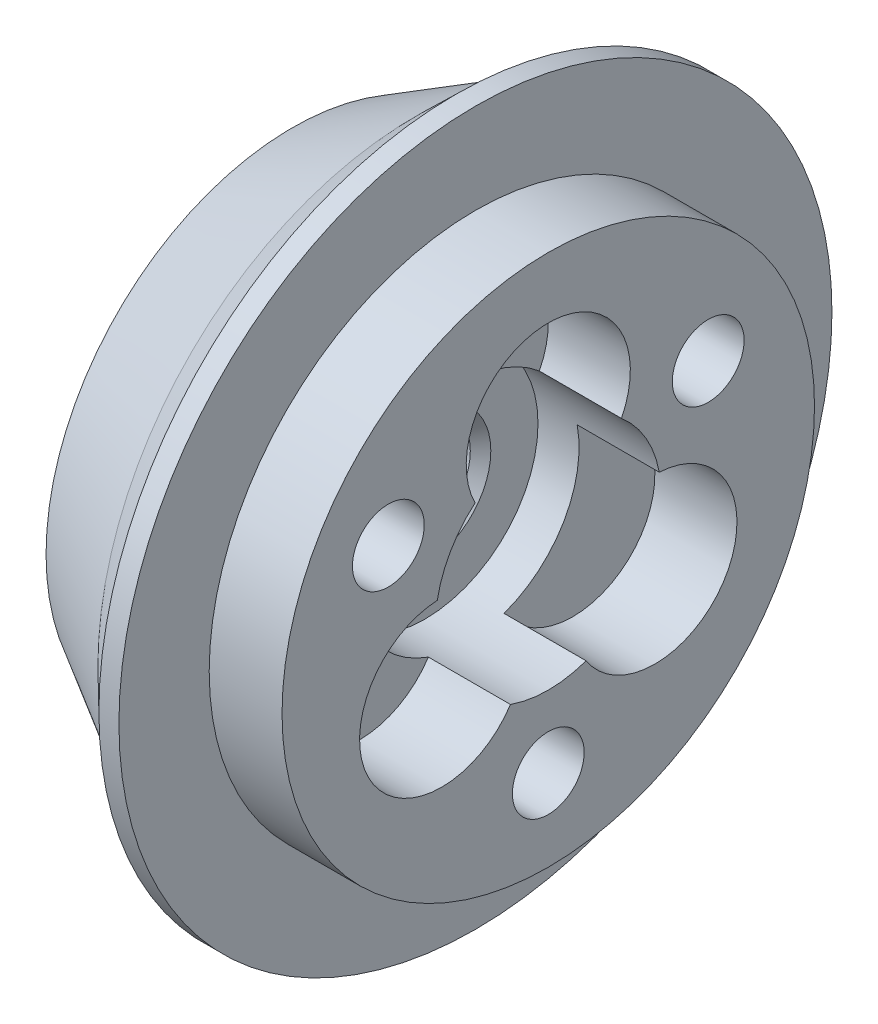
from build123d import *

# Parameters (mm, degrees)
CHANFREIN1_SIZE           = 0.2
CHANFREIN2_SIZE           = 1
ESQUISSE3_R               = 8
ENL_V_MAT_EXTRU_1_DEPTH   = 8
ENL_V_MAT_EXTRU_2_DEPTH   = 10
TROU_TARAUD_M8X1_02_D     = 7
TROU_TARAUD_M8X1_02_DEPTH = 13
TROU_TARAUD_M8X1_02_TIP   = 2.103012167


with BuildPart() as part:
    # Esquisse1 → R_volution1 (revolve)
    with BuildSketch(Plane.XY, mode=Mode.PRIVATE) as r_volution1_sk:
        Polygon((0, 0), (0, 24), (11.951150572, 30.9), (15.9, 34.75), (17.851150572, 34.75), (17.851150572, 25.95), (24.951150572, 25.95), (24.951150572, 0), align=None)
    revolve(r_volution1_sk.sketch.rotate(Axis((0, 0, 0), (1, 0, 0)), 90), axis=Axis((0, 0, 0), (1, 0, 0)))

    # Esquisse2 → Enl_vement de mati_re-R_volution1 (revolve, cut)
    with BuildSketch(Plane.XY, mode=Mode.PRIVATE) as enl_vement_de_mati_re_r_volution1_sk:
        Polygon((0, 2.01), (5.951150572, 2.01), (5.951150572, 5.4), (12.951150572, 5.4), (12.951150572, 11), (24.951150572, 11), (24.951150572, 0), (0, 0), align=None)
    revolve(enl_vement_de_mati_re_r_volution1_sk.sketch.rotate(Axis((0, 0, 0), (1, 0, 0)), 90), axis=Axis((0, 0, 0), (1, 0, 0)), mode=Mode.SUBTRACT)

    # Chanfrein1
    chanfrein1_edges = [part.edges().sort_by_distance(p)[0] for p in [
        (0, 0, -2.01),
        (5.951150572, 0, -2.01),
    ]]
    chamfer(chanfrein1_edges, length=CHANFREIN1_SIZE)

    # Chanfrein2
    chanfrein2_edges = [part.edges().sort_by_distance(p)[0] for p in [
        (12.951150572, 0, -5.4),
    ]]
    chamfer(chanfrein2_edges, length=CHANFREIN2_SIZE)

    # Esquisse3 → Enl_v. mat.-Extru.1 (cut)
    with BuildSketch(Plane(origin=(24.951150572, 0, 0), x_dir=(0, 0, -1), z_dir=(1, 0, 0))):
        with Locations((0, 12)):
            Circle(ESQUISSE3_R)
        with Locations((10.392304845, -6)):
            Circle(ESQUISSE3_R)
        with Locations((-10.392304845, -6)):
            Circle(ESQUISSE3_R)
    extrude(amount=-ENL_V_MAT_EXTRU_1_DEPTH, mode=Mode.SUBTRACT)

    # Esquisse6 → Enl_v. mat.-Extru.2 (cut)
    with BuildSketch(Plane.ZY):
        with BuildLine():
            ThreePointArc((3.078947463, 3.281780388), (4.5, -1.1e-07), (3.078947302, -3.281780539))
            ThreePointArc((3.078947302, -3.281780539), (2.853577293, -10.349255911), (9.921052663, -10.574625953))
            ThreePointArc((9.921052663, -10.574625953), (14.5, -7.5e-08), (9.921052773, 10.57462585))
            ThreePointArc((9.921052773, 10.57462585), (2.853577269, 10.349255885), (3.078947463, 3.281780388))
        make_face()
        with BuildLine():
            ThreePointArc((-3.078947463, -3.281780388), (-4.5, 1.6e-08), (-3.078947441, 3.28178041))
            ThreePointArc((-3.078947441, 3.28178041), (-2.853577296, 10.349255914), (-9.921052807, 10.574625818))
            ThreePointArc((-9.921052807, 10.574625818), (-14.5, -6e-09), (-9.921052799, -10.574625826))
            ThreePointArc((-9.921052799, -10.574625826), (-2.853577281, -10.349255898), (-3.078947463, -3.281780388))
        make_face()
    extrude(amount=-ENL_V_MAT_EXTRU_2_DEPTH, mode=Mode.SUBTRACT)

    # Trou taraud_ M8x1.02
    with Locations(Plane(origin=(24.951150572, 9, 15.588457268), x_dir=(0, 0, 1), z_dir=(1, 0, 0))):
        with Locations((0, 0), (-31.176914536, 0), (-15.588457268, 27)):
            Hole(TROU_TARAUD_M8X1_02_D / 2, depth=TROU_TARAUD_M8X1_02_DEPTH)
            with Locations((0, 0, -(TROU_TARAUD_M8X1_02_DEPTH + TROU_TARAUD_M8X1_02_TIP / 2))):  # 118° drill point
                Cone(0, TROU_TARAUD_M8X1_02_D / 2, TROU_TARAUD_M8X1_02_TIP, mode=Mode.SUBTRACT)


solid = part.part
